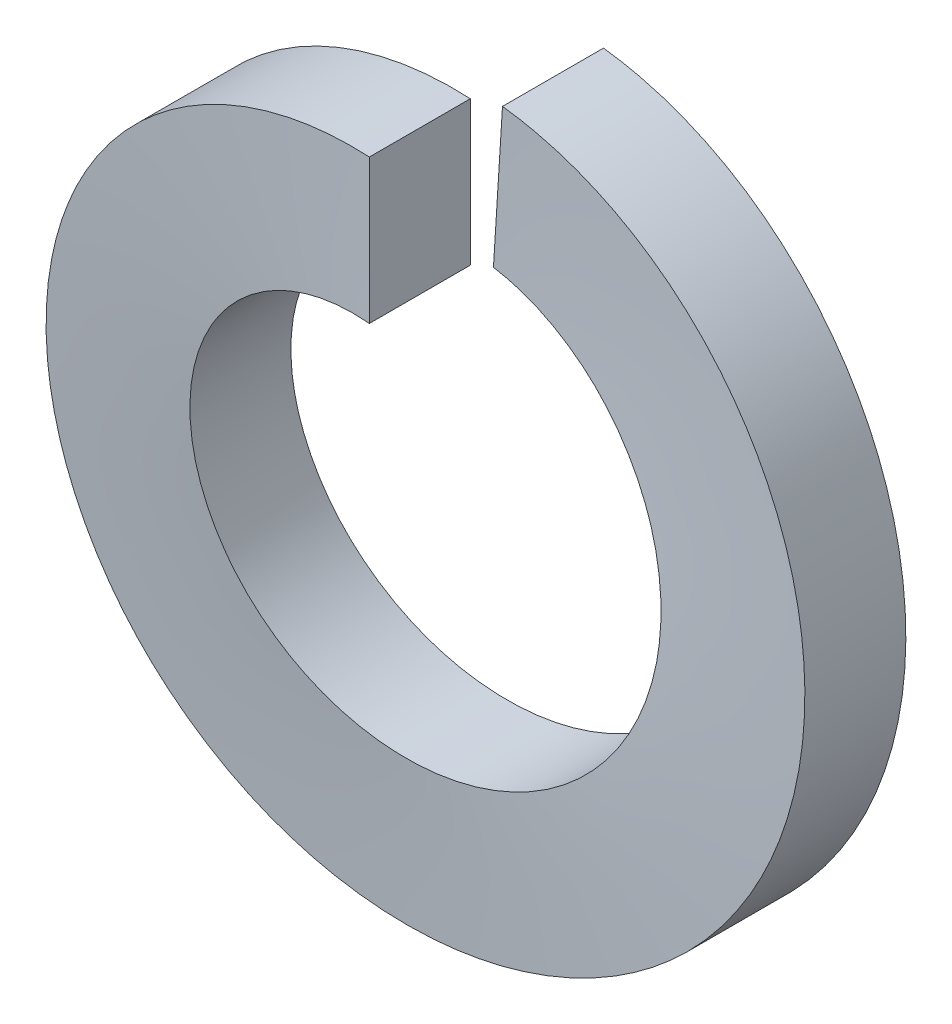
from build123d import *

# Parameters (mm, degrees)
SWEEP1_PITCH       = 3.527777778
SWEEP1_HEIGHT      = 3.4925
SWEEP1_RADIUS      = 11.0363
SWEEP1_START_ANGLE = 90
SKETCH2_W          = 3.175
SKETCH2_H          = 4.5339


with BuildPart() as part:
    # Sweep1: sweep along a helix
    with BuildLine() as sweep1_path:
        add(Helix(SWEEP1_PITCH, SWEEP1_HEIGHT, SWEEP1_RADIUS, center=(0, 0, 0), direction=(0, 0, -1), lefthand=True, mode=Mode.PRIVATE).rotate(Axis((0, 0, 0), (0, 0, -1)), SWEEP1_START_ANGLE))
    # Sketch2 → Sweep1 (sweep)
    with BuildSketch(Plane(origin=(0, 0, 0), x_dir=(0, 0, -1), z_dir=(1, 0, 0))):
        with Locations((-1.5875, 8.76935)):
            Rectangle(SKETCH2_W, SKETCH2_H)
    sweep(path=sweep1_path.line, is_frenet=True)


solid = part.part
